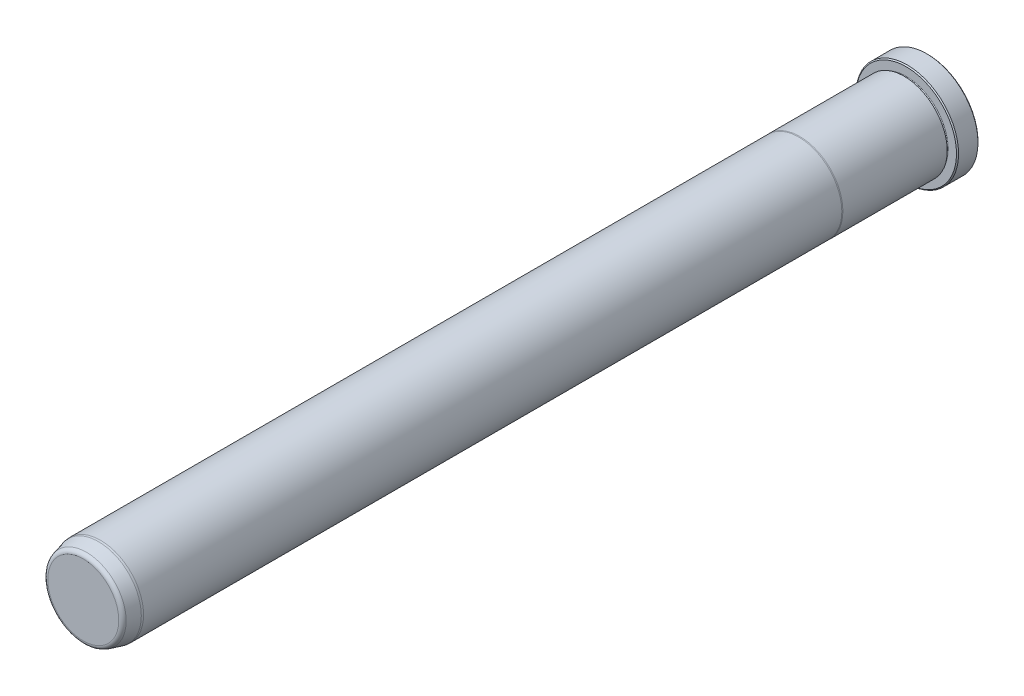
ISO-10303-21;
HEADER;
FILE_DESCRIPTION(('STEP AP214'),'2;1');
FILE_NAME('part.step','',(''),(''),'','','');
FILE_SCHEMA(('AUTOMOTIVE_DESIGN { 1 0 10303 214 1 1 1 1 }'));
ENDSEC;
DATA;
#1=APPLICATION_CONTEXT('core data for automotive mechanical design processes');
#2=APPLICATION_PROTOCOL_DEFINITION('international standard','automotive_design',2000,#1);
#3=PRODUCT_CONTEXT('',#1,'mechanical');
#4=PRODUCT('Part','Part','',(#3));
#5=PRODUCT_RELATED_PRODUCT_CATEGORY('part','',(#4));
#6=PRODUCT_DEFINITION_FORMATION('','',#4);
#7=PRODUCT_DEFINITION_CONTEXT('part definition',#1,'design');
#8=PRODUCT_DEFINITION('design','',#6,#7);
#9=PRODUCT_DEFINITION_SHAPE('','',#8);
#10=(LENGTH_UNIT() NAMED_UNIT(*) SI_UNIT(.MILLI.,.METRE.));
#11=(NAMED_UNIT(*) PLANE_ANGLE_UNIT() SI_UNIT($,.RADIAN.));
#12=(NAMED_UNIT(*) SI_UNIT($,.STERADIAN.) SOLID_ANGLE_UNIT());
#13=UNCERTAINTY_MEASURE_WITH_UNIT(LENGTH_MEASURE(1.E-05),#10,'distance_accuracy_value','');
#14=(GEOMETRIC_REPRESENTATION_CONTEXT(3) GLOBAL_UNCERTAINTY_ASSIGNED_CONTEXT((#13)) GLOBAL_UNIT_ASSIGNED_CONTEXT((#10,
#11,#12)) REPRESENTATION_CONTEXT('',''));
#15=CARTESIAN_POINT('',(0.,0.,0.));
#16=DIRECTION('',(0.,0.,1.));
#17=DIRECTION('',(1.,0.,0.));
#18=AXIS2_PLACEMENT_3D('',#15,#16,#17);
#19=CARTESIAN_POINT('',(0.,0.,0.));
#20=DIRECTION('',(0.,0.,1.));
#21=DIRECTION('',(1.,0.,0.));
#22=AXIS2_PLACEMENT_3D('',#19,#20,#21);
#23=PLANE('',#22);
#24=CARTESIAN_POINT('',(0.,0.,0.));
#25=DIRECTION('',(0.,0.,1.));
#26=DIRECTION('',(1.,0.,0.));
#27=AXIS2_PLACEMENT_3D('',#24,#25,#26);
#28=CIRCLE('',#27,18.542);
#29=CARTESIAN_POINT('',(18.542,0.,0.));
#30=VERTEX_POINT('',#29);
#31=EDGE_CURVE('E37',#30,#30,#28,.F.);
#32=ORIENTED_EDGE('',*,*,#31,.T.);
#33=EDGE_LOOP('',(#32));
#34=FACE_BOUND('',#33,.T.);
#35=ADVANCED_FACE('F30',(#34),#23,.F.);
#36=CARTESIAN_POINT('',(0.,0.,0.));
#37=DIRECTION('',(0.,0.,1.));
#38=DIRECTION('',(1.,0.,0.));
#39=AXIS2_PLACEMENT_3D('',#36,#37,#38);
#40=CYLINDRICAL_SURFACE('',#39,18.923);
#41=CARTESIAN_POINT('',(0.,0.,0.38099999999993));
#42=DIRECTION('',(0.,0.,1.));
#43=DIRECTION('',(1.,0.,0.));
#44=AXIS2_PLACEMENT_3D('',#41,#42,#43);
#45=CIRCLE('',#44,18.923);
#46=CARTESIAN_POINT('',(18.923,0.,0.38099999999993));
#47=VERTEX_POINT('',#46);
#48=EDGE_CURVE('E41',#47,#47,#45,.T.);
#49=ORIENTED_EDGE('',*,*,#48,.T.);
#50=EDGE_LOOP('',(#49));
#51=FACE_BOUND('',#50,.T.);
#52=CARTESIAN_POINT('',(0.,0.,7.54379999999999));
#53=DIRECTION('',(0.,0.,-1.));
#54=DIRECTION('',(-1.,0.,0.));
#55=AXIS2_PLACEMENT_3D('',#52,#53,#54);
#56=CIRCLE('',#55,18.923);
#57=CARTESIAN_POINT('',(-18.923,0.,7.54379999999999));
#58=VERTEX_POINT('',#57);
#59=EDGE_CURVE('E45',#58,#58,#56,.T.);
#60=ORIENTED_EDGE('',*,*,#59,.T.);
#61=EDGE_LOOP('',(#60));
#62=FACE_BOUND('',#61,.T.);
#63=ADVANCED_FACE('F118',(#51,#62),#40,.T.);
#64=CARTESIAN_POINT('',(0.,18.923,7.9248));
#65=DIRECTION('',(0.,0.,-1.));
#66=DIRECTION('',(-1.,0.,0.));
#67=AXIS2_PLACEMENT_3D('',#64,#65,#66);
#68=PLANE('',#67);
#69=CARTESIAN_POINT('',(0.,0.,7.9248));
#70=DIRECTION('',(0.,0.,-1.));
#71=DIRECTION('',(-1.,0.,0.));
#72=AXIS2_PLACEMENT_3D('',#69,#70,#71);
#73=CIRCLE('',#72,18.542);
#74=CARTESIAN_POINT('',(-18.542,0.,7.9248));
#75=VERTEX_POINT('',#74);
#76=EDGE_CURVE('E10',#75,#75,#73,.F.);
#77=ORIENTED_EDGE('',*,*,#76,.T.);
#78=EDGE_LOOP('',(#77));
#79=FACE_BOUND('',#78,.T.);
#80=CARTESIAN_POINT('',(0.,0.,7.9248));
#81=DIRECTION('',(0.,0.,1.));
#82=DIRECTION('',(1.,0.,0.));
#83=AXIS2_PLACEMENT_3D('',#80,#81,#82);
#84=CIRCLE('',#83,15.4813);
#85=CARTESIAN_POINT('',(15.4813,0.,7.9248));
#86=VERTEX_POINT('',#85);
#87=EDGE_CURVE('E56',#86,#86,#84,.T.);
#88=ORIENTED_EDGE('',*,*,#87,.F.);
#89=EDGE_LOOP('',(#88));
#90=FACE_BOUND('',#89,.T.);
#91=ADVANCED_FACE('F113',(#79,#90),#68,.F.);
#92=CARTESIAN_POINT('',(0.,0.,8.3058));
#93=DIRECTION('',(0.,0.,1.));
#94=DIRECTION('',(1.,0.,0.));
#95=AXIS2_PLACEMENT_3D('',#92,#93,#94);
#96=TOROIDAL_SURFACE('',#95,15.4813,0.381000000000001);
#97=CARTESIAN_POINT('',(0.,0.,8.6868));
#98=DIRECTION('',(0.,0.,1.));
#99=DIRECTION('',(1.,0.,0.));
#100=AXIS2_PLACEMENT_3D('',#97,#98,#99);
#101=CIRCLE('',#100,15.4813);
#102=CARTESIAN_POINT('',(15.4813,0.,8.6868));
#103=VERTEX_POINT('',#102);
#104=EDGE_CURVE('E59',#103,#103,#101,.T.);
#105=ORIENTED_EDGE('',*,*,#104,.F.);
#106=EDGE_LOOP('',(#105));
#107=FACE_BOUND('',#106,.T.);
#108=ORIENTED_EDGE('',*,*,#87,.T.);
#109=EDGE_LOOP('',(#108));
#110=FACE_BOUND('',#109,.T.);
#111=ADVANCED_FACE('F107',(#107,#110),#96,.F.);
#112=CARTESIAN_POINT('',(0.,15.4813,8.6868));
#113=DIRECTION('',(0.,0.,1.));
#114=DIRECTION('',(1.,0.,0.));
#115=AXIS2_PLACEMENT_3D('',#112,#113,#114);
#116=PLANE('',#115);
#117=CARTESIAN_POINT('',(0.,0.,8.6868));
#118=DIRECTION('',(0.,0.,1.));
#119=DIRECTION('',(1.,0.,0.));
#120=AXIS2_PLACEMENT_3D('',#117,#118,#119);
#121=CIRCLE('',#120,15.8877);
#122=CARTESIAN_POINT('',(15.8877,0.,8.6868));
#123=VERTEX_POINT('',#122);
#124=EDGE_CURVE('E62',#123,#123,#121,.T.);
#125=ORIENTED_EDGE('',*,*,#124,.F.);
#126=EDGE_LOOP('',(#125));
#127=FACE_BOUND('',#126,.T.);
#128=ORIENTED_EDGE('',*,*,#104,.T.);
#129=EDGE_LOOP('',(#128));
#130=FACE_BOUND('',#129,.T.);
#131=ADVANCED_FACE('F101',(#127,#130),#116,.F.);
#132=CARTESIAN_POINT('',(0.,0.,0.));
#133=DIRECTION('',(0.,0.,1.));
#134=DIRECTION('',(1.,0.,0.));
#135=AXIS2_PLACEMENT_3D('',#132,#133,#134);
#136=CYLINDRICAL_SURFACE('',#135,15.8877);
#137=CARTESIAN_POINT('',(0.,0.,47.1347630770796));
#138=DIRECTION('',(0.,0.,1.));
#139=DIRECTION('',(1.,0.,0.));
#140=AXIS2_PLACEMENT_3D('',#137,#138,#139);
#141=CIRCLE('',#140,15.8877);
#142=CARTESIAN_POINT('',(15.8877,0.,47.1347630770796));
#143=VERTEX_POINT('',#142);
#144=EDGE_CURVE('E65',#143,#143,#141,.T.);
#145=ORIENTED_EDGE('',*,*,#144,.F.);
#146=EDGE_LOOP('',(#145));
#147=FACE_BOUND('',#146,.T.);
#148=ORIENTED_EDGE('',*,*,#124,.T.);
#149=EDGE_LOOP('',(#148));
#150=FACE_BOUND('',#149,.T.);
#151=ADVANCED_FACE('F95',(#147,#150),#136,.T.);
#152=CARTESIAN_POINT('',(0.,0.,47.1347630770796));
#153=DIRECTION('',(0.,0.,-1.));
#154=DIRECTION('',(-1.,0.,0.));
#155=AXIS2_PLACEMENT_3D('',#152,#153,#154);
#156=CONICAL_SURFACE('',#155,15.8877,0.0698131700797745);
#157=CARTESIAN_POINT('',(0.,0.,47.498));
#158=DIRECTION('',(0.,0.,1.));
#159=DIRECTION('',(1.,0.,0.));
#160=AXIS2_PLACEMENT_3D('',#157,#158,#159);
#161=CIRCLE('',#160,15.8623);
#162=CARTESIAN_POINT('',(15.8623,0.,47.498));
#163=VERTEX_POINT('',#162);
#164=EDGE_CURVE('E68',#163,#163,#161,.T.);
#165=ORIENTED_EDGE('',*,*,#164,.F.);
#166=EDGE_LOOP('',(#165));
#167=FACE_BOUND('',#166,.T.);
#168=ORIENTED_EDGE('',*,*,#144,.T.);
#169=EDGE_LOOP('',(#168));
#170=FACE_BOUND('',#169,.T.);
#171=ADVANCED_FACE('F89',(#167,#170),#156,.T.);
#172=CARTESIAN_POINT('',(0.,0.,0.));
#173=DIRECTION('',(0.,0.,1.));
#174=DIRECTION('',(1.,0.,0.));
#175=AXIS2_PLACEMENT_3D('',#172,#173,#174);
#176=CYLINDRICAL_SURFACE('',#175,15.8623);
#177=CARTESIAN_POINT('',(0.,0.,304.8));
#178=DIRECTION('',(0.,0.,1.));
#179=DIRECTION('',(1.,0.,0.));
#180=AXIS2_PLACEMENT_3D('',#177,#178,#179);
#181=CIRCLE('',#180,15.8623);
#182=CARTESIAN_POINT('',(15.8623,0.,304.8));
#183=VERTEX_POINT('',#182);
#184=EDGE_CURVE('E71',#183,#183,#181,.T.);
#185=ORIENTED_EDGE('',*,*,#184,.F.);
#186=EDGE_LOOP('',(#185));
#187=FACE_BOUND('',#186,.T.);
#188=ORIENTED_EDGE('',*,*,#164,.T.);
#189=EDGE_LOOP('',(#188));
#190=FACE_BOUND('',#189,.T.);
#191=ADVANCED_FACE('F83',(#187,#190),#176,.T.);
#192=CARTESIAN_POINT('',(0.,0.,304.8));
#193=DIRECTION('',(0.,0.,-1.));
#194=DIRECTION('',(-1.,0.,0.));
#195=AXIS2_PLACEMENT_3D('',#192,#193,#194);
#196=CONICAL_SURFACE('',#195,15.8623,0.0872664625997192);
#197=CARTESIAN_POINT('',(0.,0.,305.562));
#198=DIRECTION('',(0.,0.,1.));
#199=DIRECTION('',(1.,0.,0.));
#200=AXIS2_PLACEMENT_3D('',#197,#198,#199);
#201=CIRCLE('',#200,15.7956336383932);
#202=CARTESIAN_POINT('',(15.7956336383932,0.,305.562));
#203=VERTEX_POINT('',#202);
#204=EDGE_CURVE('E74',#203,#203,#201,.T.);
#205=ORIENTED_EDGE('',*,*,#204,.F.);
#206=EDGE_LOOP('',(#205));
#207=FACE_BOUND('',#206,.T.);
#208=ORIENTED_EDGE('',*,*,#184,.T.);
#209=EDGE_LOOP('',(#208));
#210=FACE_BOUND('',#209,.T.);
#211=ADVANCED_FACE('F80',(#207,#210),#196,.T.);
#212=CARTESIAN_POINT('',(0.,0.,305.562));
#213=DIRECTION('',(0.,0.,-1.));
#214=DIRECTION('',(-1.,0.,0.));
#215=AXIS2_PLACEMENT_3D('',#212,#213,#214);
#216=CONICAL_SURFACE('',#215,15.7956336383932,0.261799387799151);
#217=CARTESIAN_POINT('',(0.,0.,309.9733752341));
#218=DIRECTION('',(0.,0.,1.));
#219=DIRECTION('',(1.,0.,0.));
#220=AXIS2_PLACEMENT_3D('',#217,#218,#219);
#221=CIRCLE('',#220,14.6136092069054);
#222=CARTESIAN_POINT('',(14.6136092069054,0.,309.9733752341));
#223=VERTEX_POINT('',#222);
#224=EDGE_CURVE('E50',#223,#223,#221,.F.);
#225=ORIENTED_EDGE('',*,*,#224,.T.);
#226=EDGE_LOOP('',(#225));
#227=FACE_BOUND('',#226,.T.);
#228=ORIENTED_EDGE('',*,*,#204,.T.);
#229=EDGE_LOOP('',(#228));
#230=FACE_BOUND('',#229,.T.);
#231=ADVANCED_FACE('F78',(#227,#230),#216,.T.);
#232=CARTESIAN_POINT('',(0.,14.2983335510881,311.15));
#233=DIRECTION('',(0.,0.,-1.));
#234=DIRECTION('',(-1.,0.,0.));
#235=AXIS2_PLACEMENT_3D('',#232,#233,#234);
#236=PLANE('',#235);
#237=CARTESIAN_POINT('',(0.,0.,311.15));
#238=DIRECTION('',(0.,0.,-1.));
#239=DIRECTION('',(-1.,0.,0.));
#240=AXIS2_PLACEMENT_3D('',#237,#238,#239);
#241=CIRCLE('',#240,13.0802019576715);
#242=CARTESIAN_POINT('',(-13.0802019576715,0.,311.15));
#243=VERTEX_POINT('',#242);
#244=EDGE_CURVE('E53',#243,#243,#241,.F.);
#245=ORIENTED_EDGE('',*,*,#244,.T.);
#246=EDGE_LOOP('',(#245));
#247=FACE_BOUND('',#246,.T.);
#248=ADVANCED_FACE('F133',(#247),#236,.F.);
#249=CARTESIAN_POINT('',(0.,0.,309.5625));
#250=DIRECTION('',(0.,0.,-1.));
#251=DIRECTION('',(-1.,0.,0.));
#252=AXIS2_PLACEMENT_3D('',#249,#250,#251);
#253=TOROIDAL_SURFACE('',#252,13.0802019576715,1.5875);
#254=ORIENTED_EDGE('',*,*,#224,.F.);
#255=EDGE_LOOP('',(#254));
#256=FACE_BOUND('',#255,.T.);
#257=ORIENTED_EDGE('',*,*,#244,.F.);
#258=EDGE_LOOP('',(#257));
#259=FACE_BOUND('',#258,.T.);
#260=ADVANCED_FACE('F130',(#256,#259),#253,.T.);
#261=CARTESIAN_POINT('',(0.,0.,0.38099999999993));
#262=DIRECTION('',(0.,0.,1.));
#263=DIRECTION('',(1.,0.,0.));
#264=AXIS2_PLACEMENT_3D('',#261,#262,#263);
#265=CONICAL_SURFACE('',#264,18.923,0.785398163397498);
#266=ORIENTED_EDGE('',*,*,#31,.F.);
#267=EDGE_LOOP('',(#266));
#268=FACE_BOUND('',#267,.T.);
#269=ORIENTED_EDGE('',*,*,#48,.F.);
#270=EDGE_LOOP('',(#269));
#271=FACE_BOUND('',#270,.T.);
#272=ADVANCED_FACE('F132',(#268,#271),#265,.T.);
#273=CARTESIAN_POINT('',(0.,0.,7.9248));
#274=DIRECTION('',(0.,0.,-1.));
#275=DIRECTION('',(-1.,0.,0.));
#276=AXIS2_PLACEMENT_3D('',#273,#274,#275);
#277=CONICAL_SURFACE('',#276,18.542,0.785398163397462);
#278=ORIENTED_EDGE('',*,*,#59,.F.);
#279=EDGE_LOOP('',(#278));
#280=FACE_BOUND('',#279,.T.);
#281=ORIENTED_EDGE('',*,*,#76,.F.);
#282=EDGE_LOOP('',(#281));
#283=FACE_BOUND('',#282,.T.);
#284=ADVANCED_FACE('F32',(#280,#283),#277,.T.);
#285=CLOSED_SHELL('',(#35,#63,#91,#111,#131,#151,#171,#191,#211,#231,#248,#260,#272,#284));
#286=MANIFOLD_SOLID_BREP('B2',#285);
#287=ADVANCED_BREP_SHAPE_REPRESENTATION('',(#18,#286),#14);
#288=SHAPE_DEFINITION_REPRESENTATION(#9,#287);
ENDSEC;
END-ISO-10303-21;
